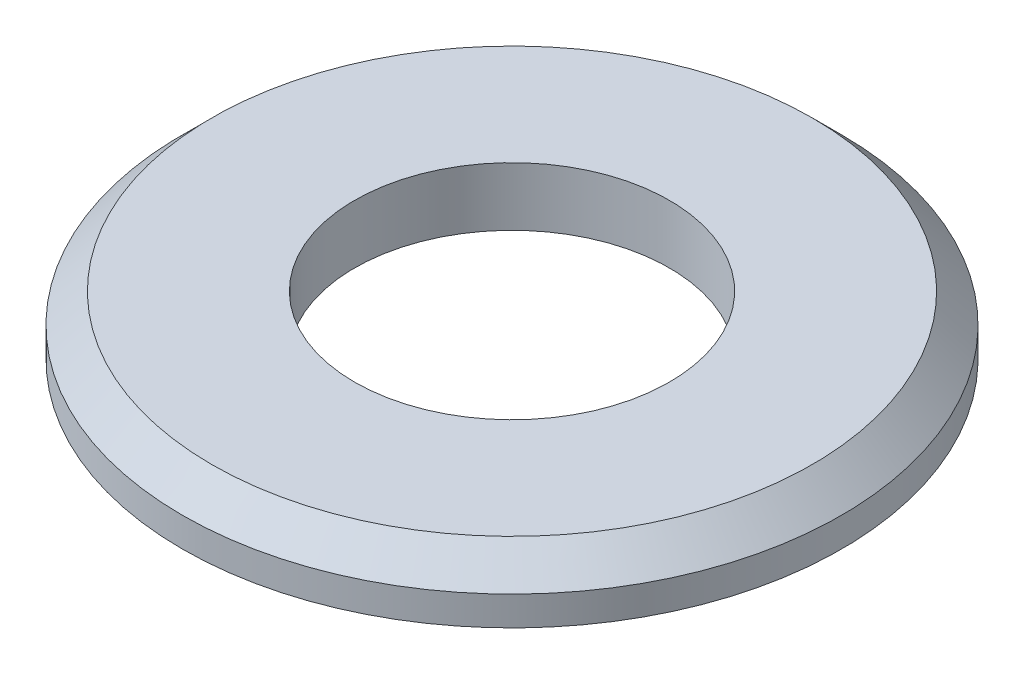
ISO-10303-21;
HEADER;
FILE_DESCRIPTION(('STEP AP214'),'2;1');
FILE_NAME('part.step','',(''),(''),'','','');
FILE_SCHEMA(('AUTOMOTIVE_DESIGN { 1 0 10303 214 1 1 1 1 }'));
ENDSEC;
DATA;
#1=APPLICATION_CONTEXT('core data for automotive mechanical design processes');
#2=APPLICATION_PROTOCOL_DEFINITION('international standard','automotive_design',2000,#1);
#3=PRODUCT_CONTEXT('',#1,'mechanical');
#4=PRODUCT('Part','Part','',(#3));
#5=PRODUCT_RELATED_PRODUCT_CATEGORY('part','',(#4));
#6=PRODUCT_DEFINITION_FORMATION('','',#4);
#7=PRODUCT_DEFINITION_CONTEXT('part definition',#1,'design');
#8=PRODUCT_DEFINITION('design','',#6,#7);
#9=PRODUCT_DEFINITION_SHAPE('','',#8);
#10=(LENGTH_UNIT() NAMED_UNIT(*) SI_UNIT(.MILLI.,.METRE.));
#11=(NAMED_UNIT(*) PLANE_ANGLE_UNIT() SI_UNIT($,.RADIAN.));
#12=(NAMED_UNIT(*) SI_UNIT($,.STERADIAN.) SOLID_ANGLE_UNIT());
#13=UNCERTAINTY_MEASURE_WITH_UNIT(LENGTH_MEASURE(1.E-05),#10,'distance_accuracy_value','');
#14=(GEOMETRIC_REPRESENTATION_CONTEXT(3) GLOBAL_UNCERTAINTY_ASSIGNED_CONTEXT((#13)) GLOBAL_UNIT_ASSIGNED_CONTEXT((#10,
#11,#12)) REPRESENTATION_CONTEXT('',''));
#15=CARTESIAN_POINT('',(0.,0.,0.));
#16=DIRECTION('',(0.,0.,1.));
#17=DIRECTION('',(1.,0.,0.));
#18=AXIS2_PLACEMENT_3D('',#15,#16,#17);
#19=CARTESIAN_POINT('',(0.,0.8,0.));
#20=DIRECTION('',(0.,1.,0.));
#21=DIRECTION('',(0.,0.,1.));
#22=AXIS2_PLACEMENT_3D('',#19,#20,#21);
#23=PLANE('',#22);
#24=CARTESIAN_POINT('',(0.,0.8,0.));
#25=DIRECTION('',(0.,1.,0.));
#26=DIRECTION('',(0.,0.,1.));
#27=AXIS2_PLACEMENT_3D('',#24,#25,#26);
#28=CIRCLE('',#27,4.1);
#29=CARTESIAN_POINT('',(0.,0.8,4.1));
#30=VERTEX_POINT('',#29);
#31=EDGE_CURVE('E35',#30,#30,#28,.T.);
#32=ORIENTED_EDGE('',*,*,#31,.T.);
#33=EDGE_LOOP('',(#32));
#34=FACE_BOUND('',#33,.T.);
#35=CARTESIAN_POINT('',(0.,0.8,0.));
#36=DIRECTION('',(0.,1.,0.));
#37=DIRECTION('',(0.,0.,1.));
#38=AXIS2_PLACEMENT_3D('',#35,#36,#37);
#39=CIRCLE('',#38,2.15);
#40=CARTESIAN_POINT('',(0.,0.8,2.15));
#41=VERTEX_POINT('',#40);
#42=EDGE_CURVE('E43',#41,#41,#39,.T.);
#43=ORIENTED_EDGE('',*,*,#42,.F.);
#44=EDGE_LOOP('',(#43));
#45=FACE_BOUND('',#44,.T.);
#46=ADVANCED_FACE('F28',(#34,#45),#23,.T.);
#47=CARTESIAN_POINT('',(0.,0.,0.));
#48=DIRECTION('',(0.,1.,0.));
#49=DIRECTION('',(0.,0.,1.));
#50=AXIS2_PLACEMENT_3D('',#47,#48,#49);
#51=PLANE('',#50);
#52=CARTESIAN_POINT('',(0.,0.,0.));
#53=DIRECTION('',(0.,1.,0.));
#54=DIRECTION('',(0.,0.,1.));
#55=AXIS2_PLACEMENT_3D('',#52,#53,#54);
#56=CIRCLE('',#55,4.5);
#57=CARTESIAN_POINT('',(0.,0.,4.5));
#58=VERTEX_POINT('',#57);
#59=EDGE_CURVE('E39',#58,#58,#56,.T.);
#60=ORIENTED_EDGE('',*,*,#59,.F.);
#61=EDGE_LOOP('',(#60));
#62=FACE_BOUND('',#61,.T.);
#63=CARTESIAN_POINT('',(0.,0.,0.));
#64=DIRECTION('',(0.,1.,0.));
#65=DIRECTION('',(0.,0.,1.));
#66=AXIS2_PLACEMENT_3D('',#63,#64,#65);
#67=CIRCLE('',#66,2.15);
#68=CARTESIAN_POINT('',(0.,0.,2.15));
#69=VERTEX_POINT('',#68);
#70=EDGE_CURVE('E48',#69,#69,#67,.T.);
#71=ORIENTED_EDGE('',*,*,#70,.T.);
#72=EDGE_LOOP('',(#71));
#73=FACE_BOUND('',#72,.T.);
#74=ADVANCED_FACE('F52',(#62,#73),#51,.F.);
#75=CARTESIAN_POINT('',(0.,0.8,0.));
#76=DIRECTION('',(0.,-1.,0.));
#77=DIRECTION('',(0.,0.,-1.));
#78=AXIS2_PLACEMENT_3D('',#75,#76,#77);
#79=CYLINDRICAL_SURFACE('',#78,4.5);
#80=CARTESIAN_POINT('',(0.,0.399999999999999,0.));
#81=DIRECTION('',(0.,1.,0.));
#82=DIRECTION('',(0.,0.,1.));
#83=AXIS2_PLACEMENT_3D('',#80,#81,#82);
#84=CIRCLE('',#83,4.5);
#85=CARTESIAN_POINT('',(0.,0.399999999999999,4.5));
#86=VERTEX_POINT('',#85);
#87=EDGE_CURVE('E10',#86,#86,#84,.F.);
#88=ORIENTED_EDGE('',*,*,#87,.T.);
#89=EDGE_LOOP('',(#88));
#90=FACE_BOUND('',#89,.T.);
#91=ORIENTED_EDGE('',*,*,#59,.T.);
#92=EDGE_LOOP('',(#91));
#93=FACE_BOUND('',#92,.T.);
#94=ADVANCED_FACE('F30',(#90,#93),#79,.T.);
#95=CARTESIAN_POINT('',(0.,0.8,0.));
#96=DIRECTION('',(0.,-1.,0.));
#97=DIRECTION('',(0.,0.,-1.));
#98=AXIS2_PLACEMENT_3D('',#95,#96,#97);
#99=CYLINDRICAL_SURFACE('',#98,2.15);
#100=ORIENTED_EDGE('',*,*,#42,.T.);
#101=EDGE_LOOP('',(#100));
#102=FACE_BOUND('',#101,.T.);
#103=ORIENTED_EDGE('',*,*,#70,.F.);
#104=EDGE_LOOP('',(#103));
#105=FACE_BOUND('',#104,.T.);
#106=ADVANCED_FACE('F54',(#102,#105),#99,.F.);
#107=CARTESIAN_POINT('',(0.,0.8,0.));
#108=DIRECTION('',(0.,-1.,0.));
#109=DIRECTION('',(0.,0.,-1.));
#110=AXIS2_PLACEMENT_3D('',#107,#108,#109);
#111=CONICAL_SURFACE('',#110,4.1,0.785398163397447);
#112=ORIENTED_EDGE('',*,*,#87,.F.);
#113=EDGE_LOOP('',(#112));
#114=FACE_BOUND('',#113,.T.);
#115=ORIENTED_EDGE('',*,*,#31,.F.);
#116=EDGE_LOOP('',(#115));
#117=FACE_BOUND('',#116,.T.);
#118=ADVANCED_FACE('F56',(#114,#117),#111,.T.);
#119=CLOSED_SHELL('',(#46,#74,#94,#106,#118));
#120=MANIFOLD_SOLID_BREP('B2',#119);
#121=ADVANCED_BREP_SHAPE_REPRESENTATION('',(#18,#120),#14);
#122=SHAPE_DEFINITION_REPRESENTATION(#9,#121);
ENDSEC;
END-ISO-10303-21;
